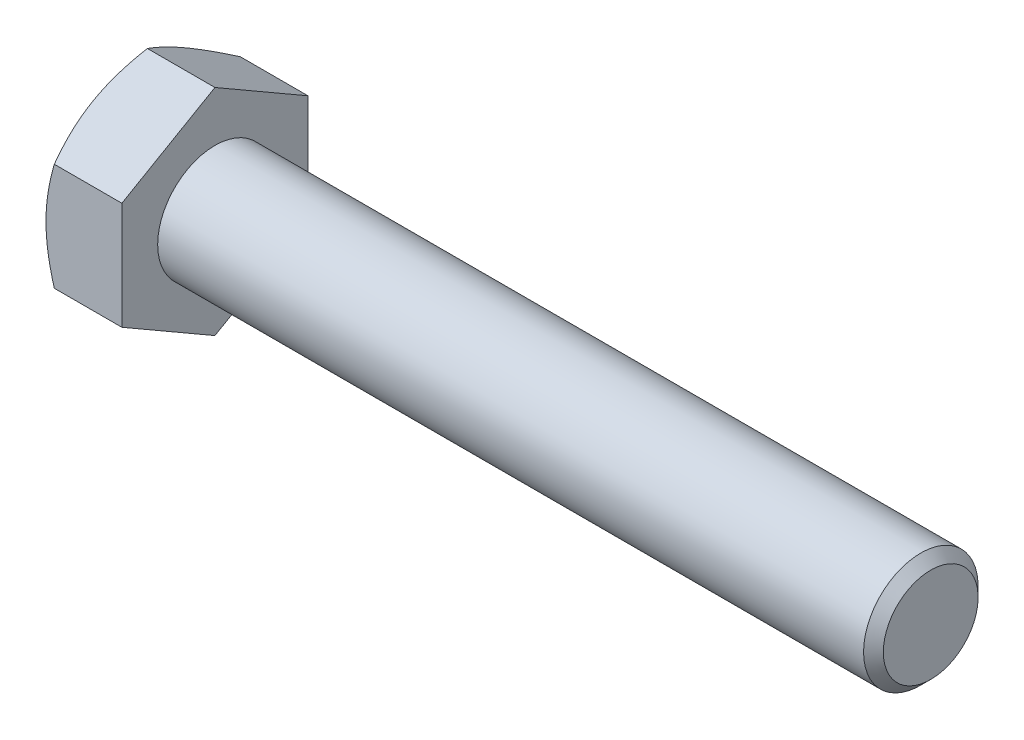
from build123d import *

# Parameters (mm, degrees)
BASEHEAD_DEPTH = 5.3


with BuildPart() as part:
    # Sketch1 → BaseHead (new body)
    with BuildSketch(Plane(origin=(0, 0, 0), x_dir=(0, 0, -1), z_dir=(1, 0, 0))):
        Polygon((6.5, 3.75277675), (6.5, -3.75277675), (0, -7.505553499), (-6.5, -3.75277675), (-6.5, 3.75277675), (0, 7.505553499), align=None)
    extrude(amount=BASEHEAD_DEPTH)

    # BodySke → BaseBody (revolve)
    with BuildSketch(Plane.XY, mode=Mode.PRIVATE) as basebody_sk:
        Polygon((0, 0), (55.3, 0), (55.3, 3.3095), (54.6095, 4), (0, 4), align=None)
    revolve(basebody_sk.sketch.rotate(Axis((0, 0, 0), (1, 0, 0)), 90), axis=Axis((0, 0, 0), (1, 0, 0)))

    # Sketch3 → HeadChamfer (revolve, cut)
    with BuildSketch(Plane.XY):
        Polygon((0, 6.5), (3.46730793, 12.505553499), (3.46730793, 17.505553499), (-10, 17.505553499), (-10, 6.5), align=None)
    revolve(axis=Axis((0, 0, 0), (1, 0, 0)), mode=Mode.SUBTRACT)


solid = part.part
